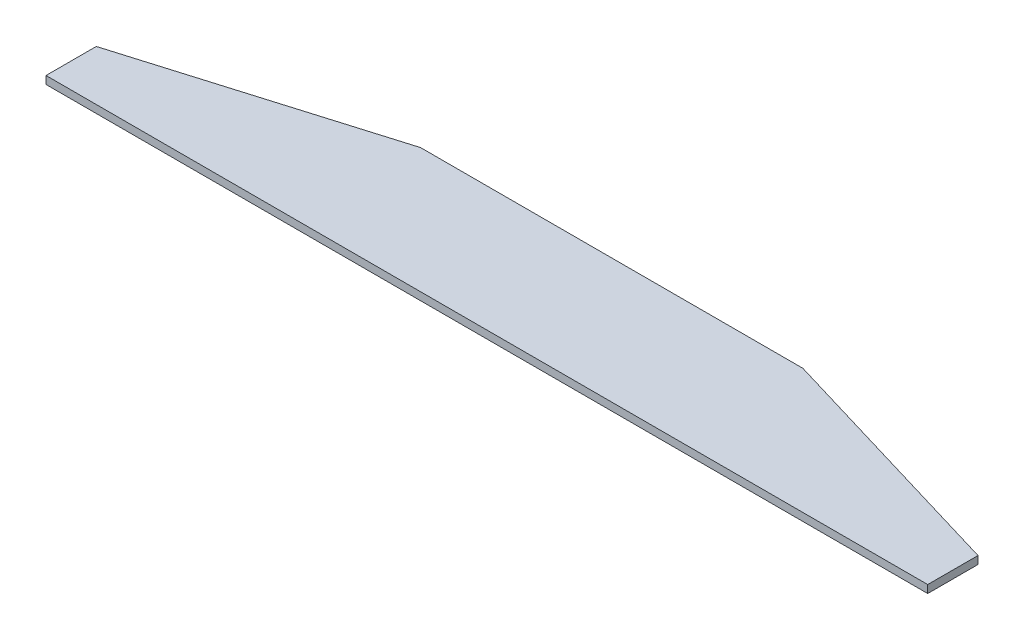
ISO-10303-21;
HEADER;
FILE_DESCRIPTION(('STEP AP214'),'2;1');
FILE_NAME('part.step','',(''),(''),'','','');
FILE_SCHEMA(('AUTOMOTIVE_DESIGN { 1 0 10303 214 1 1 1 1 }'));
ENDSEC;
DATA;
#1=APPLICATION_CONTEXT('core data for automotive mechanical design processes');
#2=APPLICATION_PROTOCOL_DEFINITION('international standard','automotive_design',2000,#1);
#3=PRODUCT_CONTEXT('',#1,'mechanical');
#4=PRODUCT('Part','Part','',(#3));
#5=PRODUCT_RELATED_PRODUCT_CATEGORY('part','',(#4));
#6=PRODUCT_DEFINITION_FORMATION('','',#4);
#7=PRODUCT_DEFINITION_CONTEXT('part definition',#1,'design');
#8=PRODUCT_DEFINITION('design','',#6,#7);
#9=PRODUCT_DEFINITION_SHAPE('','',#8);
#10=(LENGTH_UNIT() NAMED_UNIT(*) SI_UNIT(.MILLI.,.METRE.));
#11=(NAMED_UNIT(*) PLANE_ANGLE_UNIT() SI_UNIT($,.RADIAN.));
#12=(NAMED_UNIT(*) SI_UNIT($,.STERADIAN.) SOLID_ANGLE_UNIT());
#13=UNCERTAINTY_MEASURE_WITH_UNIT(LENGTH_MEASURE(1.E-05),#10,'distance_accuracy_value','');
#14=(GEOMETRIC_REPRESENTATION_CONTEXT(3) GLOBAL_UNCERTAINTY_ASSIGNED_CONTEXT((#13)) GLOBAL_UNIT_ASSIGNED_CONTEXT((#10,
#11,#12)) REPRESENTATION_CONTEXT('',''));
#15=CARTESIAN_POINT('',(0.,0.,0.));
#16=DIRECTION('',(0.,0.,1.));
#17=DIRECTION('',(1.,0.,0.));
#18=AXIS2_PLACEMENT_3D('',#15,#16,#17);
#19=CARTESIAN_POINT('',(0.,6.35,0.));
#20=DIRECTION('',(1.,0.,0.));
#21=DIRECTION('',(0.,0.,-1.));
#22=AXIS2_PLACEMENT_3D('',#19,#20,#21);
#23=PLANE('',#22);
#24=DIRECTION('',(0.,0.,1.));
#25=VECTOR('',#24,1.);
#26=CARTESIAN_POINT('',(0.,0.,0.));
#27=LINE('',#26,#25);
#28=CARTESIAN_POINT('',(0.,0.,-40.9193999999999));
#29=VERTEX_POINT('',#28);
#30=CARTESIAN_POINT('',(0.,0.,0.));
#31=VERTEX_POINT('',#30);
#32=EDGE_CURVE('E82',#29,#31,#27,.T.);
#33=ORIENTED_EDGE('',*,*,#32,.T.);
#34=DIRECTION('',(0.,-1.,0.));
#35=VECTOR('',#34,1.);
#36=CARTESIAN_POINT('',(0.,6.35,0.));
#37=LINE('',#36,#35);
#38=CARTESIAN_POINT('',(0.,6.35,0.));
#39=VERTEX_POINT('',#38);
#40=EDGE_CURVE('E11',#39,#31,#37,.T.);
#41=ORIENTED_EDGE('',*,*,#40,.F.);
#42=DIRECTION('',(0.,0.,1.));
#43=VECTOR('',#42,1.);
#44=CARTESIAN_POINT('',(0.,6.35,0.));
#45=LINE('',#44,#43);
#46=CARTESIAN_POINT('',(0.,6.35,-40.9193999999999));
#47=VERTEX_POINT('',#46);
#48=EDGE_CURVE('E105',#47,#39,#45,.T.);
#49=ORIENTED_EDGE('',*,*,#48,.F.);
#50=DIRECTION('',(0.,-1.,0.));
#51=VECTOR('',#50,1.);
#52=CARTESIAN_POINT('',(0.,6.35,-40.9193999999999));
#53=LINE('',#52,#51);
#54=EDGE_CURVE('E95',#47,#29,#53,.T.);
#55=ORIENTED_EDGE('',*,*,#54,.T.);
#56=EDGE_LOOP('',(#33,#41,#49,#55));
#57=FACE_BOUND('',#56,.T.);
#58=ADVANCED_FACE('F26',(#57),#23,.F.);
#59=CARTESIAN_POINT('',(0.,6.35,0.));
#60=DIRECTION('',(0.,0.,-1.));
#61=DIRECTION('',(-1.,0.,0.));
#62=AXIS2_PLACEMENT_3D('',#59,#60,#61);
#63=PLANE('',#62);
#64=DIRECTION('',(1.,0.,0.));
#65=VECTOR('',#64,1.);
#66=CARTESIAN_POINT('',(0.,0.,0.));
#67=LINE('',#66,#65);
#68=CARTESIAN_POINT('',(717.55,0.,0.));
#69=VERTEX_POINT('',#68);
#70=EDGE_CURVE('E78',#31,#69,#67,.T.);
#71=ORIENTED_EDGE('',*,*,#70,.T.);
#72=DIRECTION('',(0.,-1.,0.));
#73=VECTOR('',#72,1.);
#74=CARTESIAN_POINT('',(717.55,6.35,0.));
#75=LINE('',#74,#73);
#76=CARTESIAN_POINT('',(717.55,6.35,0.));
#77=VERTEX_POINT('',#76);
#78=EDGE_CURVE('E33',#77,#69,#75,.T.);
#79=ORIENTED_EDGE('',*,*,#78,.F.);
#80=DIRECTION('',(1.,0.,0.));
#81=VECTOR('',#80,1.);
#82=CARTESIAN_POINT('',(0.,6.35,0.));
#83=LINE('',#82,#81);
#84=EDGE_CURVE('E91',#39,#77,#83,.T.);
#85=ORIENTED_EDGE('',*,*,#84,.F.);
#86=ORIENTED_EDGE('',*,*,#40,.T.);
#87=EDGE_LOOP('',(#71,#79,#85,#86));
#88=FACE_BOUND('',#87,.T.);
#89=ADVANCED_FACE('F90',(#88),#63,.F.);
#90=CARTESIAN_POINT('',(717.55,6.35,0.));
#91=DIRECTION('',(-1.,0.,0.));
#92=DIRECTION('',(0.,0.,1.));
#93=AXIS2_PLACEMENT_3D('',#90,#91,#92);
#94=PLANE('',#93);
#95=DIRECTION('',(0.,0.,-1.));
#96=VECTOR('',#95,1.);
#97=CARTESIAN_POINT('',(717.55,0.,0.));
#98=LINE('',#97,#96);
#99=CARTESIAN_POINT('',(717.55,0.,-40.9193999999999));
#100=VERTEX_POINT('',#99);
#101=EDGE_CURVE('E84',#69,#100,#98,.T.);
#102=ORIENTED_EDGE('',*,*,#101,.T.);
#103=DIRECTION('',(0.,-1.,0.));
#104=VECTOR('',#103,1.);
#105=CARTESIAN_POINT('',(717.55,6.35,-40.9193999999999));
#106=LINE('',#105,#104);
#107=CARTESIAN_POINT('',(717.55,6.35,-40.9193999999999));
#108=VERTEX_POINT('',#107);
#109=EDGE_CURVE('E121',#108,#100,#106,.T.);
#110=ORIENTED_EDGE('',*,*,#109,.F.);
#111=DIRECTION('',(0.,0.,-1.));
#112=VECTOR('',#111,1.);
#113=CARTESIAN_POINT('',(717.55,6.35,0.));
#114=LINE('',#113,#112);
#115=EDGE_CURVE('E108',#77,#108,#114,.T.);
#116=ORIENTED_EDGE('',*,*,#115,.F.);
#117=ORIENTED_EDGE('',*,*,#78,.T.);
#118=EDGE_LOOP('',(#102,#110,#116,#117));
#119=FACE_BOUND('',#118,.T.);
#120=ADVANCED_FACE('F125',(#119),#94,.F.);
#121=CARTESIAN_POINT('',(717.55,6.35,-40.9193999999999));
#122=DIRECTION('',(-0.28613893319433,0.,0.95818813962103));
#123=DIRECTION('',(0.95818813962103,0.,0.28613893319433));
#124=AXIS2_PLACEMENT_3D('',#121,#122,#123);
#125=PLANE('',#124);
#126=DIRECTION('',(-0.95818813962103,0.,-0.28613893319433));
#127=VECTOR('',#126,1.);
#128=CARTESIAN_POINT('',(717.55,0.,-40.9193999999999));
#129=LINE('',#128,#127);
#130=CARTESIAN_POINT('',(514.35,0.,-101.6));
#131=VERTEX_POINT('',#130);
#132=EDGE_CURVE('E99',#100,#131,#129,.T.);
#133=ORIENTED_EDGE('',*,*,#132,.T.);
#134=DIRECTION('',(0.,-1.,0.));
#135=VECTOR('',#134,1.);
#136=CARTESIAN_POINT('',(514.35,6.35,-101.6));
#137=LINE('',#136,#135);
#138=CARTESIAN_POINT('',(514.35,6.35,-101.6));
#139=VERTEX_POINT('',#138);
#140=EDGE_CURVE('E118',#139,#131,#137,.T.);
#141=ORIENTED_EDGE('',*,*,#140,.F.);
#142=DIRECTION('',(-0.95818813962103,0.,-0.28613893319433));
#143=VECTOR('',#142,1.);
#144=CARTESIAN_POINT('',(717.55,6.35,-40.9193999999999));
#145=LINE('',#144,#143);
#146=EDGE_CURVE('E110',#108,#139,#145,.T.);
#147=ORIENTED_EDGE('',*,*,#146,.F.);
#148=ORIENTED_EDGE('',*,*,#109,.T.);
#149=EDGE_LOOP('',(#133,#141,#147,#148));
#150=FACE_BOUND('',#149,.T.);
#151=ADVANCED_FACE('F131',(#150),#125,.F.);
#152=CARTESIAN_POINT('',(203.2,6.35,-101.6));
#153=DIRECTION('',(0.,0.,1.));
#154=DIRECTION('',(1.,0.,0.));
#155=AXIS2_PLACEMENT_3D('',#152,#153,#154);
#156=PLANE('',#155);
#157=DIRECTION('',(-1.,0.,0.));
#158=VECTOR('',#157,1.);
#159=CARTESIAN_POINT('',(203.2,0.,-101.6));
#160=LINE('',#159,#158);
#161=CARTESIAN_POINT('',(203.2,0.,-101.6));
#162=VERTEX_POINT('',#161);
#163=EDGE_CURVE('E101',#131,#162,#160,.T.);
#164=ORIENTED_EDGE('',*,*,#163,.T.);
#165=DIRECTION('',(0.,-1.,0.));
#166=VECTOR('',#165,1.);
#167=CARTESIAN_POINT('',(203.2,6.35,-101.6));
#168=LINE('',#167,#166);
#169=CARTESIAN_POINT('',(203.2,6.35,-101.6));
#170=VERTEX_POINT('',#169);
#171=EDGE_CURVE('E115',#170,#162,#168,.T.);
#172=ORIENTED_EDGE('',*,*,#171,.F.);
#173=DIRECTION('',(-1.,0.,0.));
#174=VECTOR('',#173,1.);
#175=CARTESIAN_POINT('',(203.2,6.35,-101.6));
#176=LINE('',#175,#174);
#177=EDGE_CURVE('E45',#139,#170,#176,.T.);
#178=ORIENTED_EDGE('',*,*,#177,.F.);
#179=ORIENTED_EDGE('',*,*,#140,.T.);
#180=EDGE_LOOP('',(#164,#172,#178,#179));
#181=FACE_BOUND('',#180,.T.);
#182=ADVANCED_FACE('F134',(#181),#156,.F.);
#183=CARTESIAN_POINT('',(0.,6.35,-40.9193999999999));
#184=DIRECTION('',(0.28613893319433,0.,0.95818813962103));
#185=DIRECTION('',(0.95818813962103,0.,-0.28613893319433));
#186=AXIS2_PLACEMENT_3D('',#183,#184,#185);
#187=PLANE('',#186);
#188=DIRECTION('',(-0.95818813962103,0.,0.28613893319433));
#189=VECTOR('',#188,1.);
#190=CARTESIAN_POINT('',(0.,0.,-40.9193999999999));
#191=LINE('',#190,#189);
#192=EDGE_CURVE('E103',#162,#29,#191,.T.);
#193=ORIENTED_EDGE('',*,*,#192,.T.);
#194=ORIENTED_EDGE('',*,*,#54,.F.);
#195=DIRECTION('',(-0.95818813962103,0.,0.28613893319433));
#196=VECTOR('',#195,1.);
#197=CARTESIAN_POINT('',(0.,6.35,-40.9193999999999));
#198=LINE('',#197,#196);
#199=EDGE_CURVE('E40',#170,#47,#198,.T.);
#200=ORIENTED_EDGE('',*,*,#199,.F.);
#201=ORIENTED_EDGE('',*,*,#171,.T.);
#202=EDGE_LOOP('',(#193,#194,#200,#201));
#203=FACE_BOUND('',#202,.T.);
#204=ADVANCED_FACE('F136',(#203),#187,.F.);
#205=CARTESIAN_POINT('',(0.,6.35,-101.6));
#206=DIRECTION('',(0.,-1.,0.));
#207=DIRECTION('',(0.,0.,-1.));
#208=AXIS2_PLACEMENT_3D('',#205,#206,#207);
#209=PLANE('',#208);
#210=ORIENTED_EDGE('',*,*,#48,.T.);
#211=ORIENTED_EDGE('',*,*,#84,.T.);
#212=ORIENTED_EDGE('',*,*,#115,.T.);
#213=ORIENTED_EDGE('',*,*,#146,.T.);
#214=ORIENTED_EDGE('',*,*,#177,.T.);
#215=ORIENTED_EDGE('',*,*,#199,.T.);
#216=EDGE_LOOP('',(#210,#211,#212,#213,#214,#215));
#217=FACE_BOUND('',#216,.T.);
#218=ADVANCED_FACE('F128',(#217),#209,.F.);
#219=CARTESIAN_POINT('',(0.,0.,-101.6));
#220=DIRECTION('',(0.,-1.,0.));
#221=DIRECTION('',(0.,0.,-1.));
#222=AXIS2_PLACEMENT_3D('',#219,#220,#221);
#223=PLANE('',#222);
#224=ORIENTED_EDGE('',*,*,#32,.F.);
#225=ORIENTED_EDGE('',*,*,#192,.F.);
#226=ORIENTED_EDGE('',*,*,#163,.F.);
#227=ORIENTED_EDGE('',*,*,#132,.F.);
#228=ORIENTED_EDGE('',*,*,#101,.F.);
#229=ORIENTED_EDGE('',*,*,#70,.F.);
#230=EDGE_LOOP('',(#224,#225,#226,#227,#228,#229));
#231=FACE_BOUND('',#230,.T.);
#232=ADVANCED_FACE('F79',(#231),#223,.T.);
#233=CLOSED_SHELL('',(#58,#89,#120,#151,#182,#204,#218,#232));
#234=MANIFOLD_SOLID_BREP('B2',#233);
#235=ADVANCED_BREP_SHAPE_REPRESENTATION('',(#18,#234),#14);
#236=SHAPE_DEFINITION_REPRESENTATION(#9,#235);
ENDSEC;
END-ISO-10303-21;
